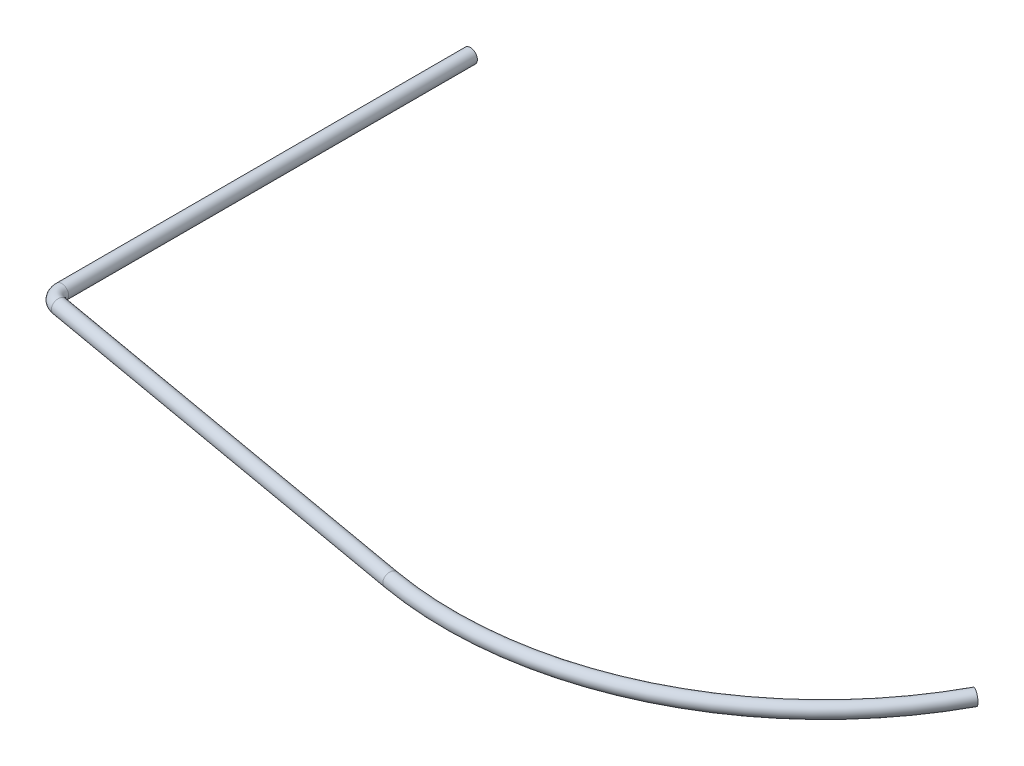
from build123d import *

# Parameters (mm, degrees)
SKETCH2_R = 1.5


with BuildPart() as part:
    # Sweep1: sweep along a path in Sketch1
    with BuildLine(Plane(origin=(0, 0, 0), x_dir=(1, 0, 0), z_dir=(0, 1, 0))) as sweep1_path:
        Line((0, 0), (0, -87.482701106))
        ThreePointArc((0, -87.482701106), (0.701866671, -89.411063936), (2.479055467, -90.437124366))
        Line((2.479055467, -90.437124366), (88.632697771, -105.62833599))
        ThreePointArc((88.632697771, -105.62833599), (137.361894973, -98.860099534), (172.916351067, -64.856800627))
    # Sketch2 → Sweep1 (sweep)
    with BuildSketch(Plane.XY):
        Circle(SKETCH2_R)
    sweep(path=sweep1_path.line)


solid = part.part
